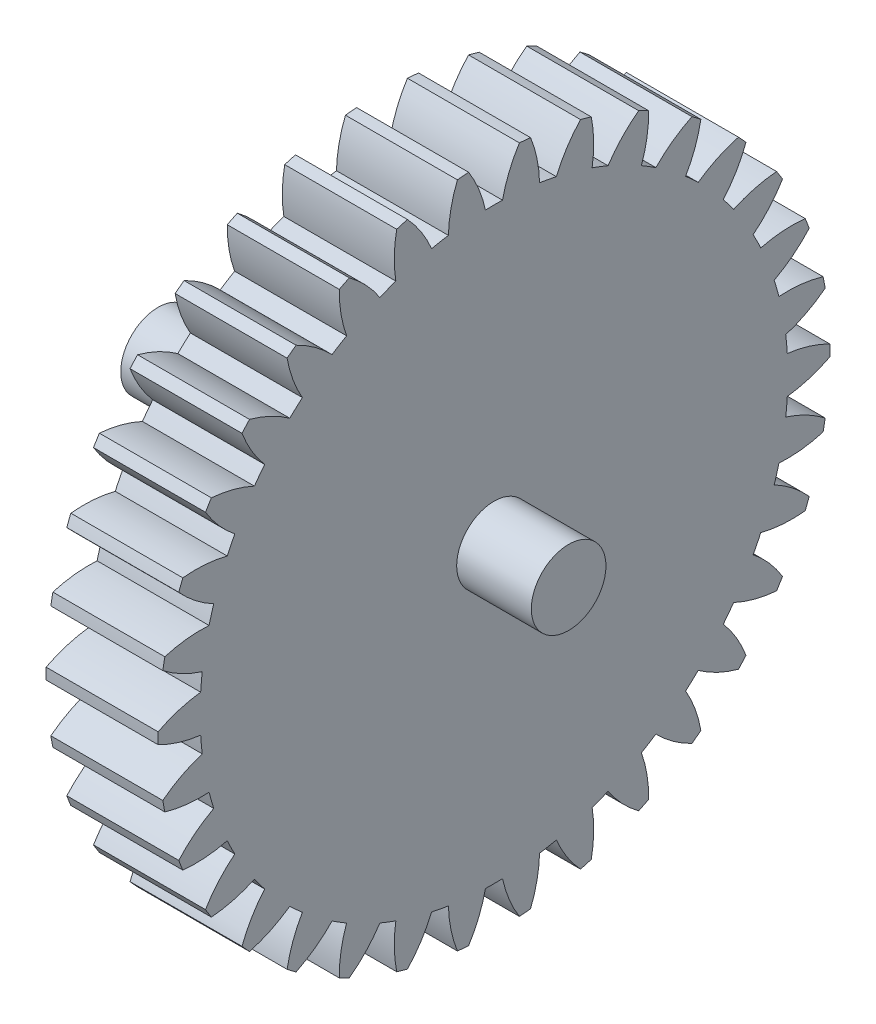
from build123d import *

# Parameters (mm, degrees)
BASPROSKE_W          = 3
BASPROSKE_H          = 9
TOOTHCUT_DEPTH       = 14.076696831
TEETHCUTS_COUNT      = 34
TEETHCUTS_ANGLE      = 349.411764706
BORSKE_R             = 0.5
BORE_DEPTH           = 4.5000508
EXTRUDE_1_DEPTH      = 2
EXTRUDE_1_DEPTH_BACK = 9
SKETCH_1_R           = 1


with BuildPart() as part:
    # BasProSke → Base-Revolve (revolve)
    with BuildSketch(Plane(origin=(0, 0, 0), x_dir=(1, 0, 0), z_dir=(0, 1, 0)), mode=Mode.PRIVATE) as base_revolve_sk:
        with Locations((1.5, 4.5)):
            Rectangle(BASPROSKE_W, BASPROSKE_H)
    revolve(base_revolve_sk.sketch.rotate(Axis((-10, 0, 0), (1, 0, 0)), 180), axis=Axis((-10, 0, 0), (1, 0, 0)))

    # TooCutSke → ToothCut (cut, through all)
    with BuildSketch(Plane(origin=(0, 0, 0), x_dir=(0, 0, -1), z_dir=(1, 0, 0))):
        with BuildLine():
            ThreePointArc((0.228967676, 7.870670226), (0, 7.874), (-0.228967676, 7.870670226))
            ThreePointArc((-0.228967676, 7.870670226), (-0.411667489, 8.455734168), (-0.69644023, 8.99848966))
            ThreePointArc((-0.69644023, 8.99848966), (0, 9.0254), (0.69644023, 8.99848966))
            ThreePointArc((0.69644023, 8.99848966), (0.411667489, 8.455734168), (0.228967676, 7.870670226))
        make_face()
    toothcut = extrude(amount=TOOTHCUT_DEPTH, mode=Mode.SUBTRACT)

    # TeethCuts: ToothCut ×34 about axis
    teethcuts_axis = Axis((-10, 0, 0), (1, 0, 0))
    for i in range(1, TEETHCUTS_COUNT):
        add(toothcut.rotate(teethcuts_axis, i * TEETHCUTS_ANGLE / (TEETHCUTS_COUNT - 1)), mode=Mode.SUBTRACT)

    # BorSke → Bore (cut, symmetric)
    with BuildSketch(Plane(origin=(0, 0, 0), x_dir=(0, 0, -1), z_dir=(1, 0, 0))):
        with Locations(Location((0, 0, 0), (0, 0, 180))):
            Circle(BORSKE_R)
    extrude(amount=BORE_DEPTH, both=True, mode=Mode.SUBTRACT)

    # Sketch 1 → Extrude 1 (add, two sides: drawn at the far end of the back side and taken through both)
    with BuildSketch(Plane(origin=(3, 0, 0), x_dir=(0, 0, -1), z_dir=(1, 0, 0)).offset(-EXTRUDE_1_DEPTH_BACK)):
        Circle(SKETCH_1_R)
    extrude(amount=EXTRUDE_1_DEPTH + EXTRUDE_1_DEPTH_BACK)


solid = part.part
